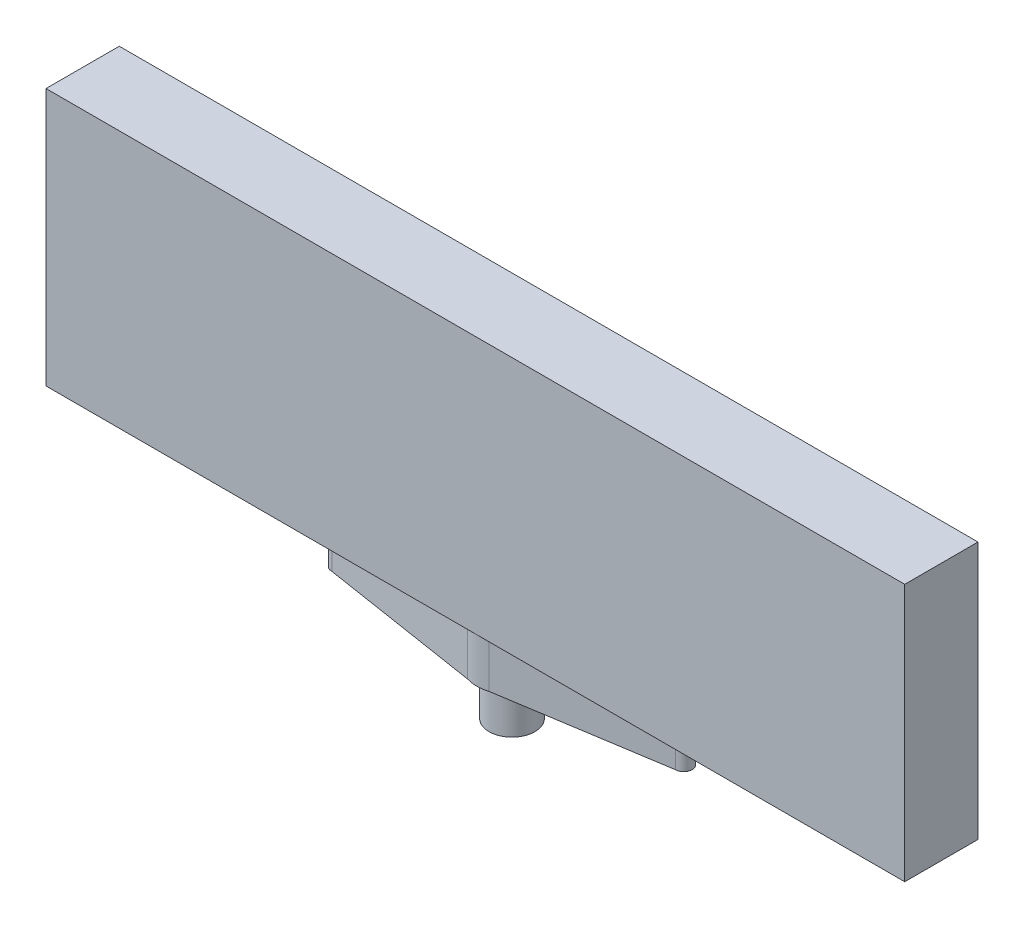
ISO-10303-21;
HEADER;
FILE_DESCRIPTION(('STEP AP214'),'2;1');
FILE_NAME('part.step','',(''),(''),'','','');
FILE_SCHEMA(('AUTOMOTIVE_DESIGN { 1 0 10303 214 1 1 1 1 }'));
ENDSEC;
DATA;
#1=APPLICATION_CONTEXT('core data for automotive mechanical design processes');
#2=APPLICATION_PROTOCOL_DEFINITION('international standard','automotive_design',2000,#1);
#3=PRODUCT_CONTEXT('',#1,'mechanical');
#4=PRODUCT('Part','Part','',(#3));
#5=PRODUCT_RELATED_PRODUCT_CATEGORY('part','',(#4));
#6=PRODUCT_DEFINITION_FORMATION('','',#4);
#7=PRODUCT_DEFINITION_CONTEXT('part definition',#1,'design');
#8=PRODUCT_DEFINITION('design','',#6,#7);
#9=PRODUCT_DEFINITION_SHAPE('','',#8);
#10=(LENGTH_UNIT() NAMED_UNIT(*) SI_UNIT(.MILLI.,.METRE.));
#11=(NAMED_UNIT(*) PLANE_ANGLE_UNIT() SI_UNIT($,.RADIAN.));
#12=(NAMED_UNIT(*) SI_UNIT($,.STERADIAN.) SOLID_ANGLE_UNIT());
#13=UNCERTAINTY_MEASURE_WITH_UNIT(LENGTH_MEASURE(1.E-05),#10,'distance_accuracy_value','');
#14=(GEOMETRIC_REPRESENTATION_CONTEXT(3) GLOBAL_UNCERTAINTY_ASSIGNED_CONTEXT((#13)) GLOBAL_UNIT_ASSIGNED_CONTEXT((#10,
#11,#12)) REPRESENTATION_CONTEXT('',''));
#15=CARTESIAN_POINT('',(0.,0.,0.));
#16=DIRECTION('',(0.,0.,1.));
#17=DIRECTION('',(1.,0.,0.));
#18=AXIS2_PLACEMENT_3D('',#15,#16,#17);
#19=CARTESIAN_POINT('',(0.,10.16,0.));
#20=DIRECTION('',(0.,-1.,0.));
#21=DIRECTION('',(0.,0.,-1.));
#22=AXIS2_PLACEMENT_3D('',#19,#20,#21);
#23=CYLINDRICAL_SURFACE('',#22,2.54);
#24=CARTESIAN_POINT('',(0.,0.,0.));
#25=DIRECTION('',(0.,1.,0.));
#26=DIRECTION('',(0.,0.,1.));
#27=AXIS2_PLACEMENT_3D('',#24,#25,#26);
#28=CIRCLE('',#27,2.54);
#29=CARTESIAN_POINT('',(0.,0.,2.54));
#30=VERTEX_POINT('',#29);
#31=EDGE_CURVE('E75',#30,#30,#28,.T.);
#32=ORIENTED_EDGE('',*,*,#31,.T.);
#33=EDGE_LOOP('',(#32));
#34=FACE_BOUND('',#33,.T.);
#35=CARTESIAN_POINT('',(0.,5.08,0.));
#36=DIRECTION('',(0.,1.,0.));
#37=DIRECTION('',(0.,0.,1.));
#38=AXIS2_PLACEMENT_3D('',#35,#36,#37);
#39=CIRCLE('',#38,2.54);
#40=CARTESIAN_POINT('',(0.,5.08,2.54));
#41=VERTEX_POINT('',#40);
#42=EDGE_CURVE('E12',#41,#41,#39,.T.);
#43=ORIENTED_EDGE('',*,*,#42,.F.);
#44=EDGE_LOOP('',(#43));
#45=FACE_BOUND('',#44,.T.);
#46=ADVANCED_FACE('F66',(#34,#45),#23,.T.);
#47=CARTESIAN_POINT('',(0.,0.,0.));
#48=DIRECTION('',(0.,1.,0.));
#49=DIRECTION('',(0.,0.,1.));
#50=AXIS2_PLACEMENT_3D('',#47,#48,#49);
#51=PLANE('',#50);
#52=ORIENTED_EDGE('',*,*,#31,.F.);
#53=EDGE_LOOP('',(#52));
#54=FACE_BOUND('',#53,.T.);
#55=ADVANCED_FACE('F182',(#54),#51,.F.);
#56=CARTESIAN_POINT('',(0.,10.16,0.));
#57=DIRECTION('',(0.,-1.,0.));
#58=DIRECTION('',(0.,0.,-1.));
#59=AXIS2_PLACEMENT_3D('',#56,#57,#58);
#60=CYLINDRICAL_SURFACE('',#59,3.937);
#61=DIRECTION('',(0.,-1.,0.));
#62=VECTOR('',#61,1.);
#63=CARTESIAN_POINT('',(-1.20920796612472,10.16,-3.74670323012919));
#64=LINE('',#63,#62);
#65=CARTESIAN_POINT('',(-1.20920796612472,5.08,-3.74670323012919));
#66=VERTEX_POINT('',#65);
#67=CARTESIAN_POINT('',(-1.20920796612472,10.16,-3.74670323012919));
#68=VERTEX_POINT('',#67);
#69=EDGE_CURVE('E165',#66,#68,#64,.F.);
#70=ORIENTED_EDGE('',*,*,#69,.T.);
#71=CARTESIAN_POINT('',(0.,10.16,0.));
#72=DIRECTION('',(0.,1.,0.));
#73=DIRECTION('',(0.,0.,1.));
#74=AXIS2_PLACEMENT_3D('',#71,#72,#73);
#75=CIRCLE('',#74,3.937);
#76=CARTESIAN_POINT('',(1.20920796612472,10.16,-3.74670323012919));
#77=VERTEX_POINT('',#76);
#78=EDGE_CURVE('E307',#77,#68,#75,.T.);
#79=ORIENTED_EDGE('',*,*,#78,.F.);
#80=DIRECTION('',(0.,-1.,0.));
#81=VECTOR('',#80,1.);
#82=CARTESIAN_POINT('',(1.20920796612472,10.16,-3.74670323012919));
#83=LINE('',#82,#81);
#84=CARTESIAN_POINT('',(1.20920796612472,5.08,-3.74670323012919));
#85=VERTEX_POINT('',#84);
#86=EDGE_CURVE('E168',#85,#77,#83,.F.);
#87=ORIENTED_EDGE('',*,*,#86,.F.);
#88=CARTESIAN_POINT('',(0.,5.08,0.));
#89=DIRECTION('',(0.,1.,0.));
#90=DIRECTION('',(0.,0.,1.));
#91=AXIS2_PLACEMENT_3D('',#88,#89,#90);
#92=CIRCLE('',#91,3.937);
#93=EDGE_CURVE('E142',#85,#66,#92,.T.);
#94=ORIENTED_EDGE('',*,*,#93,.T.);
#95=EDGE_LOOP('',(#70,#79,#87,#94));
#96=FACE_BOUND('',#95,.T.);
#97=ADVANCED_FACE('F184',(#96),#60,.T.);
#98=CARTESIAN_POINT('',(0.,5.08,0.));
#99=DIRECTION('',(0.,1.,0.));
#100=DIRECTION('',(0.,0.,1.));
#101=AXIS2_PLACEMENT_3D('',#98,#99,#100);
#102=PLANE('',#101);
#103=ORIENTED_EDGE('',*,*,#42,.T.);
#104=EDGE_LOOP('',(#103));
#105=FACE_BOUND('',#104,.T.);
#106=DIRECTION('',(0.987842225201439,0.,-0.155459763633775));
#107=VECTOR('',#106,1.);
#108=CARTESIAN_POINT('',(-19.05,5.08,-0.939043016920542));
#109=LINE('',#108,#107);
#110=CARTESIAN_POINT('',(-19.05,5.08,-0.939043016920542));
#111=VERTEX_POINT('',#110);
#112=EDGE_CURVE('E151',#111,#66,#109,.T.);
#113=ORIENTED_EDGE('',*,*,#112,.T.);
#114=ORIENTED_EDGE('',*,*,#93,.F.);
#115=DIRECTION('',(-0.987842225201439,0.,-0.155459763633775));
#116=VECTOR('',#115,1.);
#117=CARTESIAN_POINT('',(19.05,5.08,-0.939043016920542));
#118=LINE('',#117,#116);
#119=CARTESIAN_POINT('',(19.05,5.08,-0.939043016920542));
#120=VERTEX_POINT('',#119);
#121=EDGE_CURVE('E147',#120,#85,#118,.T.);
#122=ORIENTED_EDGE('',*,*,#121,.F.);
#123=CARTESIAN_POINT('',(19.05,5.08,0.));
#124=DIRECTION('',(0.,-1.,0.));
#125=DIRECTION('',(0.,0.,-1.));
#126=AXIS2_PLACEMENT_3D('',#123,#124,#125);
#127=CIRCLE('',#126,0.939043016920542);
#128=CARTESIAN_POINT('',(19.05,5.08,0.939043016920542));
#129=VERTEX_POINT('',#128);
#130=EDGE_CURVE('E133',#120,#129,#127,.T.);
#131=ORIENTED_EDGE('',*,*,#130,.T.);
#132=DIRECTION('',(0.987842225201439,0.,-0.155459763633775));
#133=VECTOR('',#132,1.);
#134=CARTESIAN_POINT('',(0.,5.08,3.937));
#135=LINE('',#134,#133);
#136=CARTESIAN_POINT('',(1.20920796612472,5.08,3.74670323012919));
#137=VERTEX_POINT('',#136);
#138=EDGE_CURVE('E120',#137,#129,#135,.T.);
#139=ORIENTED_EDGE('',*,*,#138,.F.);
#140=CARTESIAN_POINT('',(-1.20920796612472,5.08,3.74670323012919));
#141=VERTEX_POINT('',#140);
#142=EDGE_CURVE('E308',#141,#137,#92,.T.);
#143=ORIENTED_EDGE('',*,*,#142,.F.);
#144=DIRECTION('',(-0.987842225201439,0.,-0.155459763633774));
#145=VECTOR('',#144,1.);
#146=CARTESIAN_POINT('',(0.,5.08,3.937));
#147=LINE('',#146,#145);
#148=CARTESIAN_POINT('',(-19.05,5.08,0.939043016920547));
#149=VERTEX_POINT('',#148);
#150=EDGE_CURVE('E271',#141,#149,#147,.T.);
#151=ORIENTED_EDGE('',*,*,#150,.T.);
#152=CARTESIAN_POINT('',(-19.05,5.08,0.));
#153=DIRECTION('',(0.,1.,0.));
#154=DIRECTION('',(0.,0.,1.));
#155=AXIS2_PLACEMENT_3D('',#152,#153,#154);
#156=CIRCLE('',#155,0.939043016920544);
#157=EDGE_CURVE('E331',#111,#149,#156,.T.);
#158=ORIENTED_EDGE('',*,*,#157,.F.);
#159=EDGE_LOOP('',(#113,#114,#122,#131,#139,#143,#151,#158));
#160=FACE_BOUND('',#159,.T.);
#161=ADVANCED_FACE('F145',(#105,#160),#102,.F.);
#162=CARTESIAN_POINT('',(-1.20920796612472,10.16,3.74670323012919));
#163=VERTEX_POINT('',#162);
#164=CARTESIAN_POINT('',(1.20920796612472,10.16,3.74670323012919));
#165=VERTEX_POINT('',#164);
#166=EDGE_CURVE('E83',#163,#165,#75,.T.);
#167=ORIENTED_EDGE('',*,*,#166,.F.);
#168=DIRECTION('',(0.,-1.,0.));
#169=VECTOR('',#168,1.);
#170=CARTESIAN_POINT('',(-1.20920796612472,10.16,3.74670323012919));
#171=LINE('',#170,#169);
#172=EDGE_CURVE('E174',#163,#141,#171,.T.);
#173=ORIENTED_EDGE('',*,*,#172,.T.);
#174=ORIENTED_EDGE('',*,*,#142,.T.);
#175=DIRECTION('',(0.,-1.,0.));
#176=VECTOR('',#175,1.);
#177=CARTESIAN_POINT('',(1.20920796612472,10.16,3.74670323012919));
#178=LINE('',#177,#176);
#179=EDGE_CURVE('E126',#165,#137,#178,.T.);
#180=ORIENTED_EDGE('',*,*,#179,.F.);
#181=EDGE_LOOP('',(#167,#173,#174,#180));
#182=FACE_BOUND('',#181,.T.);
#183=ADVANCED_FACE('F191',(#182),#60,.T.);
#184=CARTESIAN_POINT('',(-19.05,10.16,0.));
#185=DIRECTION('',(0.,-1.,0.));
#186=DIRECTION('',(0.,0.,-1.));
#187=AXIS2_PLACEMENT_3D('',#184,#185,#186);
#188=CYLINDRICAL_SURFACE('',#187,0.939043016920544);
#189=ORIENTED_EDGE('',*,*,#157,.T.);
#190=DIRECTION('',(0.,-1.,0.));
#191=VECTOR('',#190,1.);
#192=CARTESIAN_POINT('',(-19.05,10.16,0.939043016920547));
#193=LINE('',#192,#191);
#194=CARTESIAN_POINT('',(-19.05,10.16,0.939043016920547));
#195=VERTEX_POINT('',#194);
#196=EDGE_CURVE('E160',#195,#149,#193,.T.);
#197=ORIENTED_EDGE('',*,*,#196,.F.);
#198=CARTESIAN_POINT('',(-19.05,10.16,0.));
#199=DIRECTION('',(0.,1.,0.));
#200=DIRECTION('',(0.,0.,1.));
#201=AXIS2_PLACEMENT_3D('',#198,#199,#200);
#202=CIRCLE('',#201,0.939043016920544);
#203=CARTESIAN_POINT('',(-19.05,10.16,-0.939043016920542));
#204=VERTEX_POINT('',#203);
#205=EDGE_CURVE('E313',#204,#195,#202,.T.);
#206=ORIENTED_EDGE('',*,*,#205,.F.);
#207=DIRECTION('',(0.,-1.,0.));
#208=VECTOR('',#207,1.);
#209=CARTESIAN_POINT('',(-19.05,10.16,-0.939043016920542));
#210=LINE('',#209,#208);
#211=EDGE_CURVE('E157',#204,#111,#210,.T.);
#212=ORIENTED_EDGE('',*,*,#211,.T.);
#213=EDGE_LOOP('',(#189,#197,#206,#212));
#214=FACE_BOUND('',#213,.T.);
#215=ADVANCED_FACE('F197',(#214),#188,.T.);
#216=CARTESIAN_POINT('',(0.,10.16,3.937));
#217=DIRECTION('',(-0.155459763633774,0.,0.987842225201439));
#218=DIRECTION('',(0.987842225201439,0.,0.155459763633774));
#219=AXIS2_PLACEMENT_3D('',#216,#217,#218);
#220=PLANE('',#219);
#221=ORIENTED_EDGE('',*,*,#172,.F.);
#222=DIRECTION('',(-0.987842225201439,0.,-0.155459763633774));
#223=VECTOR('',#222,1.);
#224=CARTESIAN_POINT('',(0.,10.16,3.937));
#225=LINE('',#224,#223);
#226=EDGE_CURVE('E132',#163,#195,#225,.T.);
#227=ORIENTED_EDGE('',*,*,#226,.T.);
#228=ORIENTED_EDGE('',*,*,#196,.T.);
#229=ORIENTED_EDGE('',*,*,#150,.F.);
#230=EDGE_LOOP('',(#221,#227,#228,#229));
#231=FACE_BOUND('',#230,.T.);
#232=ADVANCED_FACE('F193',(#231),#220,.T.);
#233=CARTESIAN_POINT('',(-19.05,10.16,-0.939043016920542));
#234=DIRECTION('',(-0.155459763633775,0.,-0.987842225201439));
#235=DIRECTION('',(-0.987842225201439,0.,0.155459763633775));
#236=AXIS2_PLACEMENT_3D('',#233,#234,#235);
#237=PLANE('',#236);
#238=ORIENTED_EDGE('',*,*,#69,.F.);
#239=ORIENTED_EDGE('',*,*,#112,.F.);
#240=ORIENTED_EDGE('',*,*,#211,.F.);
#241=DIRECTION('',(0.987842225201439,0.,-0.155459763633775));
#242=VECTOR('',#241,1.);
#243=CARTESIAN_POINT('',(-19.05,10.16,-0.939043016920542));
#244=LINE('',#243,#242);
#245=EDGE_CURVE('E317',#204,#68,#244,.T.);
#246=ORIENTED_EDGE('',*,*,#245,.T.);
#247=EDGE_LOOP('',(#238,#239,#240,#246));
#248=FACE_BOUND('',#247,.T.);
#249=ADVANCED_FACE('F196',(#248),#237,.T.);
#250=CARTESIAN_POINT('',(19.05,10.16,0.));
#251=DIRECTION('',(0.,-1.,0.));
#252=DIRECTION('',(0.,0.,-1.));
#253=AXIS2_PLACEMENT_3D('',#250,#251,#252);
#254=CYLINDRICAL_SURFACE('',#253,0.939043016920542);
#255=ORIENTED_EDGE('',*,*,#130,.F.);
#256=DIRECTION('',(0.,-1.,0.));
#257=VECTOR('',#256,1.);
#258=CARTESIAN_POINT('',(19.05,10.16,-0.939043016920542));
#259=LINE('',#258,#257);
#260=CARTESIAN_POINT('',(19.05,10.16,-0.939043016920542));
#261=VERTEX_POINT('',#260);
#262=EDGE_CURVE('E114',#261,#120,#259,.T.);
#263=ORIENTED_EDGE('',*,*,#262,.F.);
#264=CARTESIAN_POINT('',(19.05,10.16,0.));
#265=DIRECTION('',(0.,-1.,0.));
#266=DIRECTION('',(0.,0.,-1.));
#267=AXIS2_PLACEMENT_3D('',#264,#265,#266);
#268=CIRCLE('',#267,0.939043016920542);
#269=CARTESIAN_POINT('',(19.05,10.16,0.939043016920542));
#270=VERTEX_POINT('',#269);
#271=EDGE_CURVE('E139',#261,#270,#268,.T.);
#272=ORIENTED_EDGE('',*,*,#271,.T.);
#273=DIRECTION('',(0.,-1.,0.));
#274=VECTOR('',#273,1.);
#275=CARTESIAN_POINT('',(19.05,10.16,0.939043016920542));
#276=LINE('',#275,#274);
#277=EDGE_CURVE('E124',#270,#129,#276,.T.);
#278=ORIENTED_EDGE('',*,*,#277,.T.);
#279=EDGE_LOOP('',(#255,#263,#272,#278));
#280=FACE_BOUND('',#279,.T.);
#281=ADVANCED_FACE('F137',(#280),#254,.T.);
#282=CARTESIAN_POINT('',(19.05,10.16,-0.939043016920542));
#283=DIRECTION('',(-0.155459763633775,0.,0.987842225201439));
#284=DIRECTION('',(0.987842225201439,0.,0.155459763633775));
#285=AXIS2_PLACEMENT_3D('',#282,#283,#284);
#286=PLANE('',#285);
#287=ORIENTED_EDGE('',*,*,#121,.T.);
#288=ORIENTED_EDGE('',*,*,#86,.T.);
#289=DIRECTION('',(-0.987842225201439,0.,-0.155459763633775));
#290=VECTOR('',#289,1.);
#291=CARTESIAN_POINT('',(19.05,10.16,-0.939043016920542));
#292=LINE('',#291,#290);
#293=EDGE_CURVE('E321',#261,#77,#292,.T.);
#294=ORIENTED_EDGE('',*,*,#293,.F.);
#295=ORIENTED_EDGE('',*,*,#262,.T.);
#296=EDGE_LOOP('',(#287,#288,#294,#295));
#297=FACE_BOUND('',#296,.T.);
#298=ADVANCED_FACE('F205',(#297),#286,.F.);
#299=CARTESIAN_POINT('',(0.,10.16,3.937));
#300=DIRECTION('',(-0.155459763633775,0.,-0.987842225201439));
#301=DIRECTION('',(-0.987842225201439,0.,0.155459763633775));
#302=AXIS2_PLACEMENT_3D('',#299,#300,#301);
#303=PLANE('',#302);
#304=DIRECTION('',(0.987842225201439,0.,-0.155459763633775));
#305=VECTOR('',#304,1.);
#306=CARTESIAN_POINT('',(0.,10.16,3.937));
#307=LINE('',#306,#305);
#308=EDGE_CURVE('E164',#165,#270,#307,.T.);
#309=ORIENTED_EDGE('',*,*,#308,.F.);
#310=ORIENTED_EDGE('',*,*,#179,.T.);
#311=ORIENTED_EDGE('',*,*,#138,.T.);
#312=ORIENTED_EDGE('',*,*,#277,.F.);
#313=EDGE_LOOP('',(#309,#310,#311,#312));
#314=FACE_BOUND('',#313,.T.);
#315=ADVANCED_FACE('F123',(#314),#303,.F.);
#316=CARTESIAN_POINT('',(-47.625,38.735,4.06400000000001));
#317=DIRECTION('',(0.,0.,-1.));
#318=DIRECTION('',(-1.,0.,0.));
#319=AXIS2_PLACEMENT_3D('',#316,#317,#318);
#320=PLANE('',#319);
#321=DIRECTION('',(1.,0.,0.));
#322=VECTOR('',#321,1.);
#323=CARTESIAN_POINT('',(-47.625,10.16,4.06400000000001));
#324=LINE('',#323,#322);
#325=CARTESIAN_POINT('',(-47.625,10.16,4.06400000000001));
#326=VERTEX_POINT('',#325);
#327=CARTESIAN_POINT('',(47.625,10.16,4.064));
#328=VERTEX_POINT('',#327);
#329=EDGE_CURVE('E267',#326,#328,#324,.T.);
#330=ORIENTED_EDGE('',*,*,#329,.T.);
#331=DIRECTION('',(0.,-1.,0.));
#332=VECTOR('',#331,1.);
#333=CARTESIAN_POINT('',(47.625,38.735,4.064));
#334=LINE('',#333,#332);
#335=CARTESIAN_POINT('',(47.625,38.735,4.064));
#336=VERTEX_POINT('',#335);
#337=EDGE_CURVE('E264',#336,#328,#334,.T.);
#338=ORIENTED_EDGE('',*,*,#337,.F.);
#339=DIRECTION('',(1.,0.,0.));
#340=VECTOR('',#339,1.);
#341=CARTESIAN_POINT('',(-47.625,38.735,4.06400000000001));
#342=LINE('',#341,#340);
#343=CARTESIAN_POINT('',(-47.625,38.735,4.06400000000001));
#344=VERTEX_POINT('',#343);
#345=EDGE_CURVE('E245',#344,#336,#342,.T.);
#346=ORIENTED_EDGE('',*,*,#345,.F.);
#347=DIRECTION('',(0.,-1.,0.));
#348=VECTOR('',#347,1.);
#349=CARTESIAN_POINT('',(-47.625,38.735,4.06400000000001));
#350=LINE('',#349,#348);
#351=EDGE_CURVE('E284',#344,#326,#350,.T.);
#352=ORIENTED_EDGE('',*,*,#351,.T.);
#353=EDGE_LOOP('',(#330,#338,#346,#352));
#354=FACE_BOUND('',#353,.T.);
#355=ADVANCED_FACE('F210',(#354),#320,.F.);
#356=CARTESIAN_POINT('',(47.625,38.735,-4.064));
#357=DIRECTION('',(1.,0.,0.));
#358=DIRECTION('',(0.,0.,-1.));
#359=AXIS2_PLACEMENT_3D('',#356,#357,#358);
#360=PLANE('',#359);
#361=DIRECTION('',(0.,0.,1.));
#362=VECTOR('',#361,1.);
#363=CARTESIAN_POINT('',(47.625,10.16,-4.064));
#364=LINE('',#363,#362);
#365=CARTESIAN_POINT('',(47.625,10.16,-4.064));
#366=VERTEX_POINT('',#365);
#367=EDGE_CURVE('E287',#366,#328,#364,.T.);
#368=ORIENTED_EDGE('',*,*,#367,.F.);
#369=DIRECTION('',(0.,-1.,0.));
#370=VECTOR('',#369,1.);
#371=CARTESIAN_POINT('',(47.625,38.735,-4.064));
#372=LINE('',#371,#370);
#373=CARTESIAN_POINT('',(47.625,38.735,-4.064));
#374=VERTEX_POINT('',#373);
#375=EDGE_CURVE('E272',#374,#366,#372,.T.);
#376=ORIENTED_EDGE('',*,*,#375,.F.);
#377=DIRECTION('',(0.,0.,1.));
#378=VECTOR('',#377,1.);
#379=CARTESIAN_POINT('',(47.625,38.735,-4.064));
#380=LINE('',#379,#378);
#381=EDGE_CURVE('E250',#374,#336,#380,.T.);
#382=ORIENTED_EDGE('',*,*,#381,.T.);
#383=ORIENTED_EDGE('',*,*,#337,.T.);
#384=EDGE_LOOP('',(#368,#376,#382,#383));
#385=FACE_BOUND('',#384,.T.);
#386=ADVANCED_FACE('F218',(#385),#360,.T.);
#387=CARTESIAN_POINT('',(-47.625,38.735,-4.06399999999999));
#388=DIRECTION('',(0.,0.,-1.));
#389=DIRECTION('',(-1.,0.,0.));
#390=AXIS2_PLACEMENT_3D('',#387,#388,#389);
#391=PLANE('',#390);
#392=DIRECTION('',(1.,0.,0.));
#393=VECTOR('',#392,1.);
#394=CARTESIAN_POINT('',(-47.625,10.16,-4.06399999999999));
#395=LINE('',#394,#393);
#396=CARTESIAN_POINT('',(-47.625,10.16,-4.06399999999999));
#397=VERTEX_POINT('',#396);
#398=EDGE_CURVE('E290',#397,#366,#395,.T.);
#399=ORIENTED_EDGE('',*,*,#398,.F.);
#400=DIRECTION('',(0.,-1.,0.));
#401=VECTOR('',#400,1.);
#402=CARTESIAN_POINT('',(-47.625,38.735,-4.06399999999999));
#403=LINE('',#402,#401);
#404=CARTESIAN_POINT('',(-47.625,38.735,-4.06399999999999));
#405=VERTEX_POINT('',#404);
#406=EDGE_CURVE('E299',#405,#397,#403,.T.);
#407=ORIENTED_EDGE('',*,*,#406,.F.);
#408=DIRECTION('',(1.,0.,0.));
#409=VECTOR('',#408,1.);
#410=CARTESIAN_POINT('',(-47.625,38.735,-4.06399999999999));
#411=LINE('',#410,#409);
#412=EDGE_CURVE('E277',#405,#374,#411,.T.);
#413=ORIENTED_EDGE('',*,*,#412,.T.);
#414=ORIENTED_EDGE('',*,*,#375,.T.);
#415=EDGE_LOOP('',(#399,#407,#413,#414));
#416=FACE_BOUND('',#415,.T.);
#417=ADVANCED_FACE('F222',(#416),#391,.T.);
#418=CARTESIAN_POINT('',(-47.625,38.735,-4.06399999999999));
#419=DIRECTION('',(1.,0.,0.));
#420=DIRECTION('',(0.,0.,-1.));
#421=AXIS2_PLACEMENT_3D('',#418,#419,#420);
#422=PLANE('',#421);
#423=DIRECTION('',(0.,0.,1.));
#424=VECTOR('',#423,1.);
#425=CARTESIAN_POINT('',(-47.625,10.16,-4.06399999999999));
#426=LINE('',#425,#424);
#427=EDGE_CURVE('E260',#397,#326,#426,.T.);
#428=ORIENTED_EDGE('',*,*,#427,.T.);
#429=ORIENTED_EDGE('',*,*,#351,.F.);
#430=DIRECTION('',(0.,0.,1.));
#431=VECTOR('',#430,1.);
#432=CARTESIAN_POINT('',(-47.625,38.735,-4.06399999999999));
#433=LINE('',#432,#431);
#434=EDGE_CURVE('E254',#405,#344,#433,.T.);
#435=ORIENTED_EDGE('',*,*,#434,.F.);
#436=ORIENTED_EDGE('',*,*,#406,.T.);
#437=EDGE_LOOP('',(#428,#429,#435,#436));
#438=FACE_BOUND('',#437,.T.);
#439=ADVANCED_FACE('F226',(#438),#422,.F.);
#440=CARTESIAN_POINT('',(0.,38.735,0.));
#441=DIRECTION('',(0.,-1.,0.));
#442=DIRECTION('',(0.,0.,-1.));
#443=AXIS2_PLACEMENT_3D('',#440,#441,#442);
#444=PLANE('',#443);
#445=ORIENTED_EDGE('',*,*,#345,.T.);
#446=ORIENTED_EDGE('',*,*,#381,.F.);
#447=ORIENTED_EDGE('',*,*,#412,.F.);
#448=ORIENTED_EDGE('',*,*,#434,.T.);
#449=EDGE_LOOP('',(#445,#446,#447,#448));
#450=FACE_BOUND('',#449,.T.);
#451=ADVANCED_FACE('F230',(#450),#444,.F.);
#452=CARTESIAN_POINT('',(0.,10.16,0.));
#453=DIRECTION('',(0.,-1.,0.));
#454=DIRECTION('',(0.,0.,-1.));
#455=AXIS2_PLACEMENT_3D('',#452,#453,#454);
#456=PLANE('',#455);
#457=ORIENTED_EDGE('',*,*,#293,.T.);
#458=ORIENTED_EDGE('',*,*,#78,.T.);
#459=ORIENTED_EDGE('',*,*,#245,.F.);
#460=ORIENTED_EDGE('',*,*,#205,.T.);
#461=ORIENTED_EDGE('',*,*,#226,.F.);
#462=ORIENTED_EDGE('',*,*,#166,.T.);
#463=ORIENTED_EDGE('',*,*,#308,.T.);
#464=ORIENTED_EDGE('',*,*,#271,.F.);
#465=EDGE_LOOP('',(#457,#458,#459,#460,#461,#462,#463,#464));
#466=FACE_BOUND('',#465,.T.);
#467=ORIENTED_EDGE('',*,*,#329,.F.);
#468=ORIENTED_EDGE('',*,*,#427,.F.);
#469=ORIENTED_EDGE('',*,*,#398,.T.);
#470=ORIENTED_EDGE('',*,*,#367,.T.);
#471=EDGE_LOOP('',(#467,#468,#469,#470));
#472=FACE_BOUND('',#471,.T.);
#473=ADVANCED_FACE('F232',(#466,#472),#456,.T.);
#474=CLOSED_SHELL('',(#46,#55,#97,#161,#183,#215,#232,#249,#281,#298,#315,#355,#386,#417,#439,
#451,#473));
#475=MANIFOLD_SOLID_BREP('B2',#474);
#476=ADVANCED_BREP_SHAPE_REPRESENTATION('',(#18,#475),#14);
#477=SHAPE_DEFINITION_REPRESENTATION(#9,#476);
ENDSEC;
END-ISO-10303-21;
